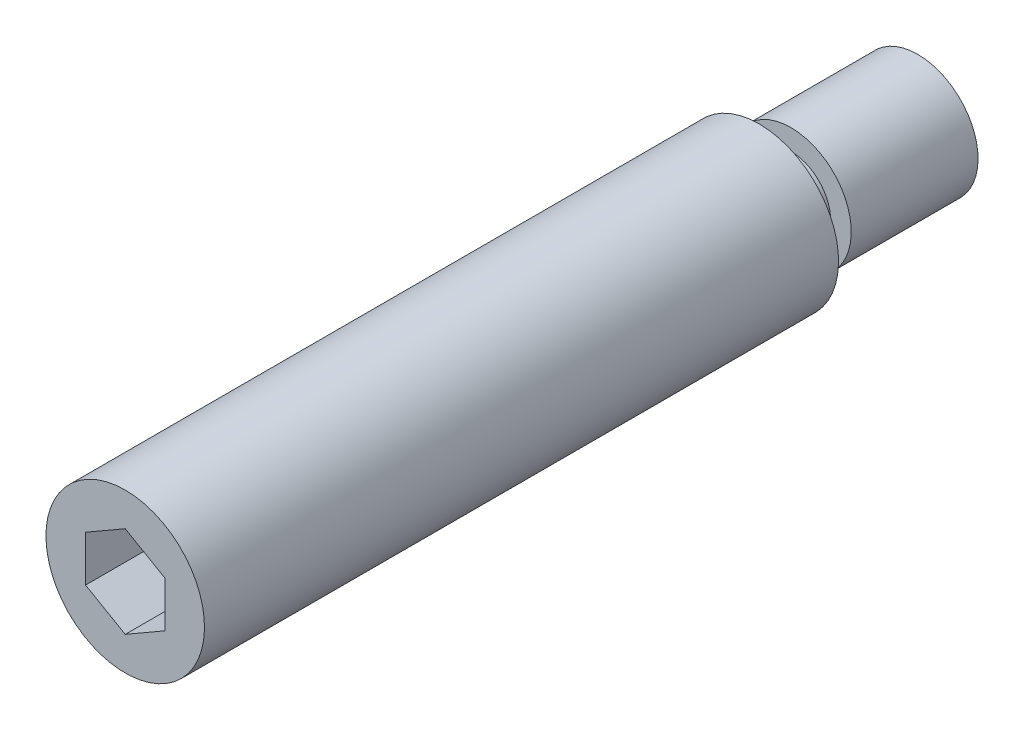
ISO-10303-21;
HEADER;
FILE_DESCRIPTION(('STEP AP214'),'2;1');
FILE_NAME('part.step','',(''),(''),'','','');
FILE_SCHEMA(('AUTOMOTIVE_DESIGN { 1 0 10303 214 1 1 1 1 }'));
ENDSEC;
DATA;
#1=APPLICATION_CONTEXT('core data for automotive mechanical design processes');
#2=APPLICATION_PROTOCOL_DEFINITION('international standard','automotive_design',2000,#1);
#3=PRODUCT_CONTEXT('',#1,'mechanical');
#4=PRODUCT('Part','Part','',(#3));
#5=PRODUCT_RELATED_PRODUCT_CATEGORY('part','',(#4));
#6=PRODUCT_DEFINITION_FORMATION('','',#4);
#7=PRODUCT_DEFINITION_CONTEXT('part definition',#1,'design');
#8=PRODUCT_DEFINITION('design','',#6,#7);
#9=PRODUCT_DEFINITION_SHAPE('','',#8);
#10=(LENGTH_UNIT() NAMED_UNIT(*) SI_UNIT(.MILLI.,.METRE.));
#11=(NAMED_UNIT(*) PLANE_ANGLE_UNIT() SI_UNIT($,.RADIAN.));
#12=(NAMED_UNIT(*) SI_UNIT($,.STERADIAN.) SOLID_ANGLE_UNIT());
#13=UNCERTAINTY_MEASURE_WITH_UNIT(LENGTH_MEASURE(1.E-05),#10,'distance_accuracy_value','');
#14=(GEOMETRIC_REPRESENTATION_CONTEXT(3) GLOBAL_UNCERTAINTY_ASSIGNED_CONTEXT((#13)) GLOBAL_UNIT_ASSIGNED_CONTEXT((#10,
#11,#12)) REPRESENTATION_CONTEXT('',''));
#15=CARTESIAN_POINT('',(0.,0.,0.));
#16=DIRECTION('',(0.,0.,1.));
#17=DIRECTION('',(1.,0.,0.));
#18=AXIS2_PLACEMENT_3D('',#15,#16,#17);
#19=CARTESIAN_POINT('',(0.,-5.,10.));
#20=DIRECTION('',(0.,0.,-1.));
#21=DIRECTION('',(0.,-1.,0.));
#22=AXIS2_PLACEMENT_3D('',#19,#20,#21);
#23=PLANE('',#22);
#24=CARTESIAN_POINT('',(0.,0.,10.));
#25=DIRECTION('',(0.,0.,1.));
#26=DIRECTION('',(0.,1.,0.));
#27=AXIS2_PLACEMENT_3D('',#24,#25,#26);
#28=CIRCLE('',#27,2.5);
#29=CARTESIAN_POINT('',(0.,2.5,10.));
#30=VERTEX_POINT('',#29);
#31=EDGE_CURVE('E115',#30,#30,#28,.T.);
#32=ORIENTED_EDGE('',*,*,#31,.T.);
#33=EDGE_LOOP('',(#32));
#34=FACE_BOUND('',#33,.T.);
#35=CARTESIAN_POINT('',(0.,0.,10.));
#36=DIRECTION('',(0.,0.,1.));
#37=DIRECTION('',(0.,1.,0.));
#38=AXIS2_PLACEMENT_3D('',#35,#36,#37);
#39=CIRCLE('',#38,5.);
#40=CARTESIAN_POINT('',(0.,5.,10.));
#41=VERTEX_POINT('',#40);
#42=EDGE_CURVE('E9',#41,#41,#39,.T.);
#43=ORIENTED_EDGE('',*,*,#42,.F.);
#44=EDGE_LOOP('',(#43));
#45=FACE_BOUND('',#44,.T.);
#46=ADVANCED_FACE('F14',(#34,#45),#23,.T.);
#47=CARTESIAN_POINT('',(0.,0.,20.));
#48=DIRECTION('',(0.,0.,1.));
#49=DIRECTION('',(0.,1.,0.));
#50=AXIS2_PLACEMENT_3D('',#47,#48,#49);
#51=CYLINDRICAL_SURFACE('',#50,5.);
#52=CARTESIAN_POINT('',(0.,0.,50.));
#53=DIRECTION('',(0.,0.,1.));
#54=DIRECTION('',(0.,1.,0.));
#55=AXIS2_PLACEMENT_3D('',#52,#53,#54);
#56=CIRCLE('',#55,5.);
#57=CARTESIAN_POINT('',(0.,5.,50.));
#58=VERTEX_POINT('',#57);
#59=EDGE_CURVE('E21',#58,#58,#56,.T.);
#60=ORIENTED_EDGE('',*,*,#59,.F.);
#61=EDGE_LOOP('',(#60));
#62=FACE_BOUND('',#61,.T.);
#63=ORIENTED_EDGE('',*,*,#42,.T.);
#64=EDGE_LOOP('',(#63));
#65=FACE_BOUND('',#64,.T.);
#66=ADVANCED_FACE('F136',(#62,#65),#51,.T.);
#67=CARTESIAN_POINT('',(0.,-5.,50.));
#68=DIRECTION('',(0.,0.,-1.));
#69=DIRECTION('',(0.,-1.,0.));
#70=AXIS2_PLACEMENT_3D('',#67,#68,#69);
#71=PLANE('',#70);
#72=DIRECTION('',(-0.866025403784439,-0.5,0.));
#73=VECTOR('',#72,1.);
#74=CARTESIAN_POINT('',(0.,2.88675134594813,50.));
#75=LINE('',#74,#73);
#76=CARTESIAN_POINT('',(0.,2.88675134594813,50.));
#77=VERTEX_POINT('',#76);
#78=CARTESIAN_POINT('',(-2.5,1.44337567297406,50.));
#79=VERTEX_POINT('',#78);
#80=EDGE_CURVE('E102',#77,#79,#75,.T.);
#81=ORIENTED_EDGE('',*,*,#80,.F.);
#82=DIRECTION('',(-0.866025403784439,0.5,0.));
#83=VECTOR('',#82,1.);
#84=CARTESIAN_POINT('',(2.5,1.44337567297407,50.));
#85=LINE('',#84,#83);
#86=CARTESIAN_POINT('',(2.5,1.44337567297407,50.));
#87=VERTEX_POINT('',#86);
#88=EDGE_CURVE('E28',#87,#77,#85,.T.);
#89=ORIENTED_EDGE('',*,*,#88,.F.);
#90=DIRECTION('',(0.,1.,0.));
#91=VECTOR('',#90,1.);
#92=CARTESIAN_POINT('',(2.5,-1.44337567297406,50.));
#93=LINE('',#92,#91);
#94=CARTESIAN_POINT('',(2.5,-1.44337567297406,50.));
#95=VERTEX_POINT('',#94);
#96=EDGE_CURVE('E111',#95,#87,#93,.T.);
#97=ORIENTED_EDGE('',*,*,#96,.F.);
#98=DIRECTION('',(0.866025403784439,0.5,0.));
#99=VECTOR('',#98,1.);
#100=CARTESIAN_POINT('',(0.,-2.88675134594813,50.));
#101=LINE('',#100,#99);
#102=CARTESIAN_POINT('',(0.,-2.88675134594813,50.));
#103=VERTEX_POINT('',#102);
#104=EDGE_CURVE('E109',#103,#95,#101,.T.);
#105=ORIENTED_EDGE('',*,*,#104,.F.);
#106=DIRECTION('',(0.866025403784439,-0.5,0.));
#107=VECTOR('',#106,1.);
#108=CARTESIAN_POINT('',(-2.5,-1.44337567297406,50.));
#109=LINE('',#108,#107);
#110=CARTESIAN_POINT('',(-2.5,-1.44337567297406,50.));
#111=VERTEX_POINT('',#110);
#112=EDGE_CURVE('E76',#111,#103,#109,.T.);
#113=ORIENTED_EDGE('',*,*,#112,.F.);
#114=DIRECTION('',(0.,-1.,0.));
#115=VECTOR('',#114,1.);
#116=CARTESIAN_POINT('',(-2.5,1.44337567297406,50.));
#117=LINE('',#116,#115);
#118=EDGE_CURVE('E105',#79,#111,#117,.T.);
#119=ORIENTED_EDGE('',*,*,#118,.F.);
#120=EDGE_LOOP('',(#81,#89,#97,#105,#113,#119));
#121=FACE_BOUND('',#120,.T.);
#122=ORIENTED_EDGE('',*,*,#59,.T.);
#123=EDGE_LOOP('',(#122));
#124=FACE_BOUND('',#123,.T.);
#125=ADVANCED_FACE('F134',(#121,#124),#71,.F.);
#126=CARTESIAN_POINT('',(0.,-3.8,0.));
#127=DIRECTION('',(0.,0.,-1.));
#128=DIRECTION('',(0.,-1.,0.));
#129=AXIS2_PLACEMENT_3D('',#126,#127,#128);
#130=PLANE('',#129);
#131=CARTESIAN_POINT('',(0.,0.,0.));
#132=DIRECTION('',(0.,0.,1.));
#133=DIRECTION('',(0.,1.,0.));
#134=AXIS2_PLACEMENT_3D('',#131,#132,#133);
#135=CIRCLE('',#134,3.8);
#136=CARTESIAN_POINT('',(0.,3.8,0.));
#137=VERTEX_POINT('',#136);
#138=EDGE_CURVE('E129',#137,#137,#135,.T.);
#139=ORIENTED_EDGE('',*,*,#138,.F.);
#140=EDGE_LOOP('',(#139));
#141=FACE_BOUND('',#140,.T.);
#142=ADVANCED_FACE('F167',(#141),#130,.T.);
#143=CARTESIAN_POINT('',(0.,0.,20.));
#144=DIRECTION('',(0.,0.,1.));
#145=DIRECTION('',(0.,1.,0.));
#146=AXIS2_PLACEMENT_3D('',#143,#144,#145);
#147=CYLINDRICAL_SURFACE('',#146,3.8);
#148=ORIENTED_EDGE('',*,*,#138,.T.);
#149=EDGE_LOOP('',(#148));
#150=FACE_BOUND('',#149,.T.);
#151=CARTESIAN_POINT('',(0.,0.,8.));
#152=DIRECTION('',(0.,0.,1.));
#153=DIRECTION('',(0.,1.,0.));
#154=AXIS2_PLACEMENT_3D('',#151,#152,#153);
#155=CIRCLE('',#154,3.8);
#156=CARTESIAN_POINT('',(0.,3.8,8.));
#157=VERTEX_POINT('',#156);
#158=EDGE_CURVE('E126',#157,#157,#155,.T.);
#159=ORIENTED_EDGE('',*,*,#158,.F.);
#160=EDGE_LOOP('',(#159));
#161=FACE_BOUND('',#160,.T.);
#162=ADVANCED_FACE('F160',(#150,#161),#147,.T.);
#163=CARTESIAN_POINT('',(0.,-2.5,8.));
#164=DIRECTION('',(0.,0.,1.));
#165=DIRECTION('',(0.,1.,0.));
#166=AXIS2_PLACEMENT_3D('',#163,#164,#165);
#167=PLANE('',#166);
#168=ORIENTED_EDGE('',*,*,#158,.T.);
#169=EDGE_LOOP('',(#168));
#170=FACE_BOUND('',#169,.T.);
#171=CARTESIAN_POINT('',(0.,0.,8.));
#172=DIRECTION('',(0.,0.,1.));
#173=DIRECTION('',(0.,1.,0.));
#174=AXIS2_PLACEMENT_3D('',#171,#172,#173);
#175=CIRCLE('',#174,2.5);
#176=CARTESIAN_POINT('',(0.,2.5,8.));
#177=VERTEX_POINT('',#176);
#178=EDGE_CURVE('E123',#177,#177,#175,.T.);
#179=ORIENTED_EDGE('',*,*,#178,.F.);
#180=EDGE_LOOP('',(#179));
#181=FACE_BOUND('',#180,.T.);
#182=ADVANCED_FACE('F151',(#170,#181),#167,.T.);
#183=CARTESIAN_POINT('',(0.,0.,20.));
#184=DIRECTION('',(0.,0.,1.));
#185=DIRECTION('',(0.,1.,0.));
#186=AXIS2_PLACEMENT_3D('',#183,#184,#185);
#187=CYLINDRICAL_SURFACE('',#186,2.5);
#188=ORIENTED_EDGE('',*,*,#178,.T.);
#189=EDGE_LOOP('',(#188));
#190=FACE_BOUND('',#189,.T.);
#191=ORIENTED_EDGE('',*,*,#31,.F.);
#192=EDGE_LOOP('',(#191));
#193=FACE_BOUND('',#192,.T.);
#194=ADVANCED_FACE('F148',(#190,#193),#187,.T.);
#195=CARTESIAN_POINT('',(2.5,1.44337567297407,44.));
#196=DIRECTION('',(0.5,0.866025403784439,0.));
#197=DIRECTION('',(-0.866025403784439,0.5,0.));
#198=AXIS2_PLACEMENT_3D('',#195,#196,#197);
#199=PLANE('',#198);
#200=ORIENTED_EDGE('',*,*,#88,.T.);
#201=DIRECTION('',(0.,0.,1.));
#202=VECTOR('',#201,1.);
#203=CARTESIAN_POINT('',(0.,2.88675134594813,44.));
#204=LINE('',#203,#202);
#205=CARTESIAN_POINT('',(0.,2.88675134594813,44.));
#206=VERTEX_POINT('',#205);
#207=EDGE_CURVE('E58',#206,#77,#204,.T.);
#208=ORIENTED_EDGE('',*,*,#207,.F.);
#209=DIRECTION('',(-0.866025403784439,0.5,0.));
#210=VECTOR('',#209,1.);
#211=CARTESIAN_POINT('',(2.5,1.44337567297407,44.));
#212=LINE('',#211,#210);
#213=CARTESIAN_POINT('',(2.5,1.44337567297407,44.));
#214=VERTEX_POINT('',#213);
#215=EDGE_CURVE('E113',#214,#206,#212,.T.);
#216=ORIENTED_EDGE('',*,*,#215,.F.);
#217=DIRECTION('',(0.,0.,1.));
#218=VECTOR('',#217,1.);
#219=CARTESIAN_POINT('',(2.5,1.44337567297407,44.));
#220=LINE('',#219,#218);
#221=EDGE_CURVE('E36',#214,#87,#220,.T.);
#222=ORIENTED_EDGE('',*,*,#221,.T.);
#223=EDGE_LOOP('',(#200,#208,#216,#222));
#224=FACE_BOUND('',#223,.T.);
#225=ADVANCED_FACE('F150',(#224),#199,.F.);
#226=CARTESIAN_POINT('',(2.5,-1.44337567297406,44.));
#227=DIRECTION('',(1.,0.,0.));
#228=DIRECTION('',(0.,0.,-1.));
#229=AXIS2_PLACEMENT_3D('',#226,#227,#228);
#230=PLANE('',#229);
#231=ORIENTED_EDGE('',*,*,#96,.T.);
#232=ORIENTED_EDGE('',*,*,#221,.F.);
#233=DIRECTION('',(0.,1.,0.));
#234=VECTOR('',#233,1.);
#235=CARTESIAN_POINT('',(2.5,-1.44337567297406,44.));
#236=LINE('',#235,#234);
#237=CARTESIAN_POINT('',(2.5,-1.44337567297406,44.));
#238=VERTEX_POINT('',#237);
#239=EDGE_CURVE('E88',#238,#214,#236,.T.);
#240=ORIENTED_EDGE('',*,*,#239,.F.);
#241=DIRECTION('',(0.,0.,1.));
#242=VECTOR('',#241,1.);
#243=CARTESIAN_POINT('',(2.5,-1.44337567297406,44.));
#244=LINE('',#243,#242);
#245=EDGE_CURVE('E80',#238,#95,#244,.T.);
#246=ORIENTED_EDGE('',*,*,#245,.T.);
#247=EDGE_LOOP('',(#231,#232,#240,#246));
#248=FACE_BOUND('',#247,.T.);
#249=ADVANCED_FACE('F158',(#248),#230,.F.);
#250=CARTESIAN_POINT('',(0.,-2.88675134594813,44.));
#251=DIRECTION('',(0.5,-0.866025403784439,0.));
#252=DIRECTION('',(0.866025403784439,0.5,0.));
#253=AXIS2_PLACEMENT_3D('',#250,#251,#252);
#254=PLANE('',#253);
#255=ORIENTED_EDGE('',*,*,#104,.T.);
#256=ORIENTED_EDGE('',*,*,#245,.F.);
#257=DIRECTION('',(0.866025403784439,0.5,0.));
#258=VECTOR('',#257,1.);
#259=CARTESIAN_POINT('',(0.,-2.88675134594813,44.));
#260=LINE('',#259,#258);
#261=CARTESIAN_POINT('',(0.,-2.88675134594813,44.));
#262=VERTEX_POINT('',#261);
#263=EDGE_CURVE('E84',#262,#238,#260,.T.);
#264=ORIENTED_EDGE('',*,*,#263,.F.);
#265=DIRECTION('',(0.,0.,1.));
#266=VECTOR('',#265,1.);
#267=CARTESIAN_POINT('',(0.,-2.88675134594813,44.));
#268=LINE('',#267,#266);
#269=EDGE_CURVE('E69',#262,#103,#268,.T.);
#270=ORIENTED_EDGE('',*,*,#269,.T.);
#271=EDGE_LOOP('',(#255,#256,#264,#270));
#272=FACE_BOUND('',#271,.T.);
#273=ADVANCED_FACE('F85',(#272),#254,.F.);
#274=CARTESIAN_POINT('',(-2.5,-1.44337567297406,44.));
#275=DIRECTION('',(-0.5,-0.866025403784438,0.));
#276=DIRECTION('',(0.866025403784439,-0.5,0.));
#277=AXIS2_PLACEMENT_3D('',#274,#275,#276);
#278=PLANE('',#277);
#279=ORIENTED_EDGE('',*,*,#112,.T.);
#280=ORIENTED_EDGE('',*,*,#269,.F.);
#281=DIRECTION('',(0.866025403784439,-0.5,0.));
#282=VECTOR('',#281,1.);
#283=CARTESIAN_POINT('',(-2.5,-1.44337567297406,44.));
#284=LINE('',#283,#282);
#285=CARTESIAN_POINT('',(-2.5,-1.44337567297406,44.));
#286=VERTEX_POINT('',#285);
#287=EDGE_CURVE('E73',#286,#262,#284,.T.);
#288=ORIENTED_EDGE('',*,*,#287,.F.);
#289=DIRECTION('',(0.,0.,1.));
#290=VECTOR('',#289,1.);
#291=CARTESIAN_POINT('',(-2.5,-1.44337567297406,44.));
#292=LINE('',#291,#290);
#293=EDGE_CURVE('E81',#286,#111,#292,.T.);
#294=ORIENTED_EDGE('',*,*,#293,.T.);
#295=EDGE_LOOP('',(#279,#280,#288,#294));
#296=FACE_BOUND('',#295,.T.);
#297=ADVANCED_FACE('F71',(#296),#278,.F.);
#298=CARTESIAN_POINT('',(-2.5,1.44337567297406,44.));
#299=DIRECTION('',(-1.,0.,0.));
#300=DIRECTION('',(0.,0.,1.));
#301=AXIS2_PLACEMENT_3D('',#298,#299,#300);
#302=PLANE('',#301);
#303=ORIENTED_EDGE('',*,*,#118,.T.);
#304=ORIENTED_EDGE('',*,*,#293,.F.);
#305=DIRECTION('',(0.,-1.,0.));
#306=VECTOR('',#305,1.);
#307=CARTESIAN_POINT('',(-2.5,1.44337567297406,44.));
#308=LINE('',#307,#306);
#309=CARTESIAN_POINT('',(-2.5,1.44337567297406,44.));
#310=VERTEX_POINT('',#309);
#311=EDGE_CURVE('E94',#310,#286,#308,.T.);
#312=ORIENTED_EDGE('',*,*,#311,.F.);
#313=DIRECTION('',(0.,0.,1.));
#314=VECTOR('',#313,1.);
#315=CARTESIAN_POINT('',(-2.5,1.44337567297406,44.));
#316=LINE('',#315,#314);
#317=EDGE_CURVE('E118',#310,#79,#316,.T.);
#318=ORIENTED_EDGE('',*,*,#317,.T.);
#319=EDGE_LOOP('',(#303,#304,#312,#318));
#320=FACE_BOUND('',#319,.T.);
#321=ADVANCED_FACE('F192',(#320),#302,.F.);
#322=CARTESIAN_POINT('',(0.,2.88675134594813,44.));
#323=DIRECTION('',(-0.5,0.866025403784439,0.));
#324=DIRECTION('',(-0.866025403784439,-0.5,0.));
#325=AXIS2_PLACEMENT_3D('',#322,#323,#324);
#326=PLANE('',#325);
#327=ORIENTED_EDGE('',*,*,#80,.T.);
#328=ORIENTED_EDGE('',*,*,#317,.F.);
#329=DIRECTION('',(-0.866025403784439,-0.5,0.));
#330=VECTOR('',#329,1.);
#331=CARTESIAN_POINT('',(0.,2.88675134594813,44.));
#332=LINE('',#331,#330);
#333=EDGE_CURVE('E96',#206,#310,#332,.T.);
#334=ORIENTED_EDGE('',*,*,#333,.F.);
#335=ORIENTED_EDGE('',*,*,#207,.T.);
#336=EDGE_LOOP('',(#327,#328,#334,#335));
#337=FACE_BOUND('',#336,.T.);
#338=ADVANCED_FACE('F180',(#337),#326,.F.);
#339=CARTESIAN_POINT('',(0.,2.88675134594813,44.));
#340=DIRECTION('',(0.,0.,1.));
#341=DIRECTION('',(1.,0.,0.));
#342=AXIS2_PLACEMENT_3D('',#339,#340,#341);
#343=PLANE('',#342);
#344=ORIENTED_EDGE('',*,*,#215,.T.);
#345=ORIENTED_EDGE('',*,*,#333,.T.);
#346=ORIENTED_EDGE('',*,*,#311,.T.);
#347=ORIENTED_EDGE('',*,*,#287,.T.);
#348=ORIENTED_EDGE('',*,*,#263,.T.);
#349=ORIENTED_EDGE('',*,*,#239,.T.);
#350=EDGE_LOOP('',(#344,#345,#346,#347,#348,#349));
#351=FACE_BOUND('',#350,.T.);
#352=ADVANCED_FACE('F91',(#351),#343,.T.);
#353=CLOSED_SHELL('',(#46,#66,#125,#142,#162,#182,#194,#225,#249,#273,#297,#321,#338,#352));
#354=MANIFOLD_SOLID_BREP('B1',#353);
#355=ADVANCED_BREP_SHAPE_REPRESENTATION('',(#18,#354),#14);
#356=SHAPE_DEFINITION_REPRESENTATION(#9,#355);
ENDSEC;
END-ISO-10303-21;
